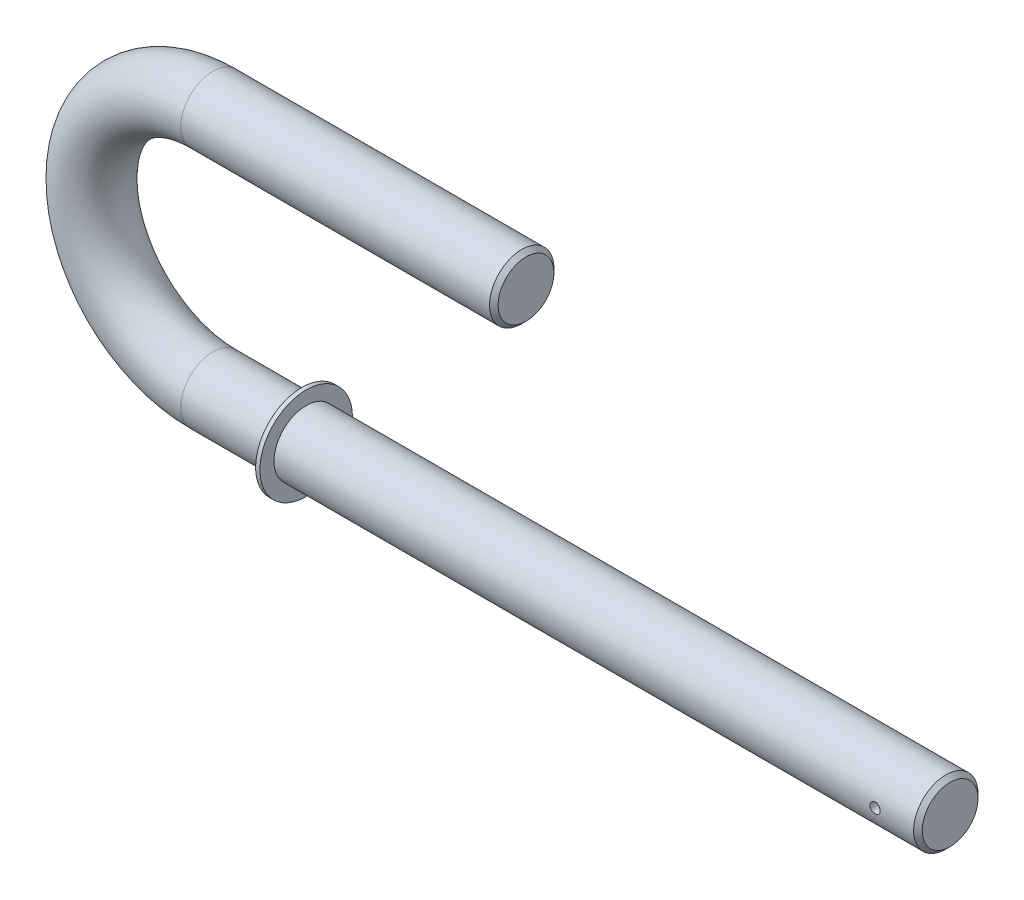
from build123d import *

# Parameters (mm, degrees)
ESQUISSE2_R                  = 7.5
CHANFREIN1_SIZE              = 1
ESQUISSE4_R                  = 10.770477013
EXTRUSION1_DEPTH             = 1
ENL_V_MAT_EXTRU_1_DEPTH      = 129.404051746
ENL_V_MAT_EXTRU_1_DEPTH_BACK = 129.404051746
ESQUISSE3_R                  = 1.200000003


with BuildPart() as part:
    # Balayage1: sweep along a path in Esquisse1
    with BuildLine(Plane.XY) as balayage1_path:
        Line((0, 0), (-72.91653727, 0))
        ThreePointArc((-72.91653727, 0), (-101.21653727, -28.3), (-72.91653727, -56.6))
        Line((-72.91653727, -56.6), (98.78346273, -56.6))
    # Esquisse2 → Balayage1 (sweep)
    with BuildSketch(Plane(origin=(0, 0, 0), x_dir=(0, 0, -1), z_dir=(1, 0, 0))):
        Circle(ESQUISSE2_R)
    sweep(path=balayage1_path.line)

    # Chanfrein1
    chanfrein1_edges = [part.edges().sort_by_distance(p)[0] for p in [
        (0, 0, 7.5),
        (98.78346273, -56.6, 7.5),
    ]]
    chamfer(chanfrein1_edges, length=CHANFREIN1_SIZE)

    # Esquisse4 → Extrusion1 (add)
    with BuildSketch(Plane(origin=(-51.21, 0, 0), x_dir=(0, 0, -1), z_dir=(1, 0, 0))):
        with Locations((0, -56.700345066)):
            Circle(ESQUISSE4_R)
    extrude(amount=-EXTRUSION1_DEPTH)

    # Esquisse3 → Enl_v. mat.-Extru.1 (cut, two sides: drawn at the far end of the back side and taken through both)
    with BuildSketch(Plane.XY.offset(-ENL_V_MAT_EXTRU_1_DEPTH_BACK)):
        with Locations((88.78346273, -56.6)):
            Circle(ESQUISSE3_R)
    extrude(amount=ENL_V_MAT_EXTRU_1_DEPTH + ENL_V_MAT_EXTRU_1_DEPTH_BACK, mode=Mode.SUBTRACT)


solid = part.part
